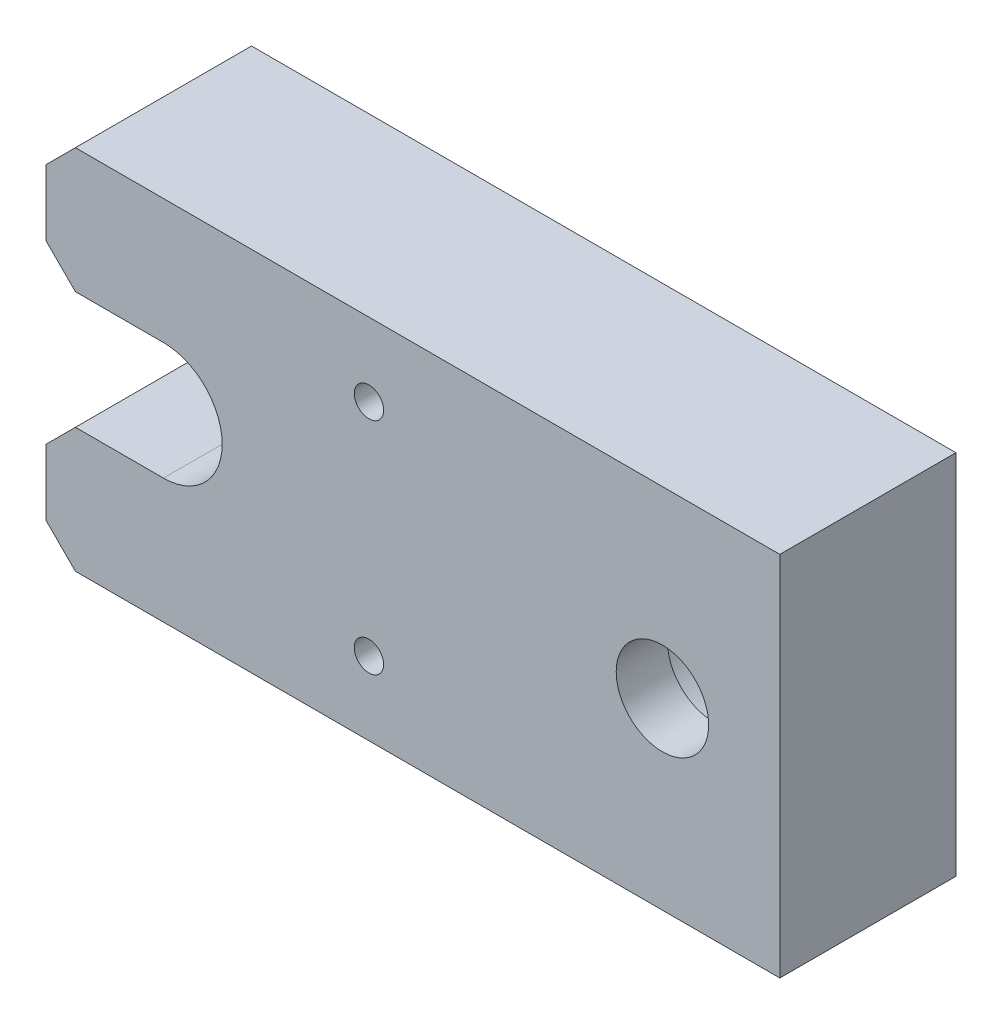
from build123d import *

# Parameters (mm, degrees)
ESQUISSE1_R             = 1
ESQUISSE1_R_2           = 3.15
BASE_EXTRUSION_DEPTH    = 12
CHANFREIN1_SIZE         = 2
ESQUISSE2_R             = 2.5
ESQUISSE2_R_2           = 5.5
ENL_V_MAT_EXTRU_1_DEPTH = 8.5


with BuildPart() as part:
    # Esquisse1 → Base-Extrusion (new body)
    with BuildSketch(Plane.XY):
        with BuildLine():
            Line((0, 0), (36, 0))
            Line((36, 0), (36, 25))
            Line((36, 25), (0, 25))
            Line((0, 25), (-14, 25))
            Line((-14, 25), (-14, 16.5))
            Line((-14, 16.5), (-6, 16.5))
            ThreePointArc((-6, 16.5), (-2, 12.5), (-6, 8.5))
            Line((-6, 8.5), (-14, 8.5))
            Line((-14, 8.5), (-14, 0))
            Line((-14, 0), (0, 0))
        make_face()
        with Locations((8, 20)):
            Circle(ESQUISSE1_R, mode=Mode.SUBTRACT)
        with Locations((8, 5)):
            Circle(ESQUISSE1_R, mode=Mode.SUBTRACT)
        with Locations((28, 12.5)):
            Circle(ESQUISSE1_R_2, mode=Mode.SUBTRACT)
    extrude(amount=BASE_EXTRUSION_DEPTH)

    # Chanfrein1
    chanfrein1_edges = [part.edges().sort_by_distance(p)[0] for p in [
        (-14, 0, 6),
        (-14, 8.5, 6),
        (-14, 16.5, 6),
        (-14, 25, 6),
    ]]
    chamfer(chanfrein1_edges, length=CHANFREIN1_SIZE)

    # Esquisse2 → Enl_v. mat.-Extru.1 (cut)
    with BuildSketch(Plane.XY):
        with Locations(Location((8, 20, 0), (0, 0, 180))):
            Circle(ESQUISSE2_R)
        with Locations(Location((8, 5, 0), (0, 0, 180))):
            Circle(ESQUISSE2_R)
        with Locations(Location((28, 12.5, 0), (0, 0, 180))):
            Circle(ESQUISSE2_R_2)
    extrude(amount=ENL_V_MAT_EXTRU_1_DEPTH, mode=Mode.SUBTRACT)


solid = part.part
